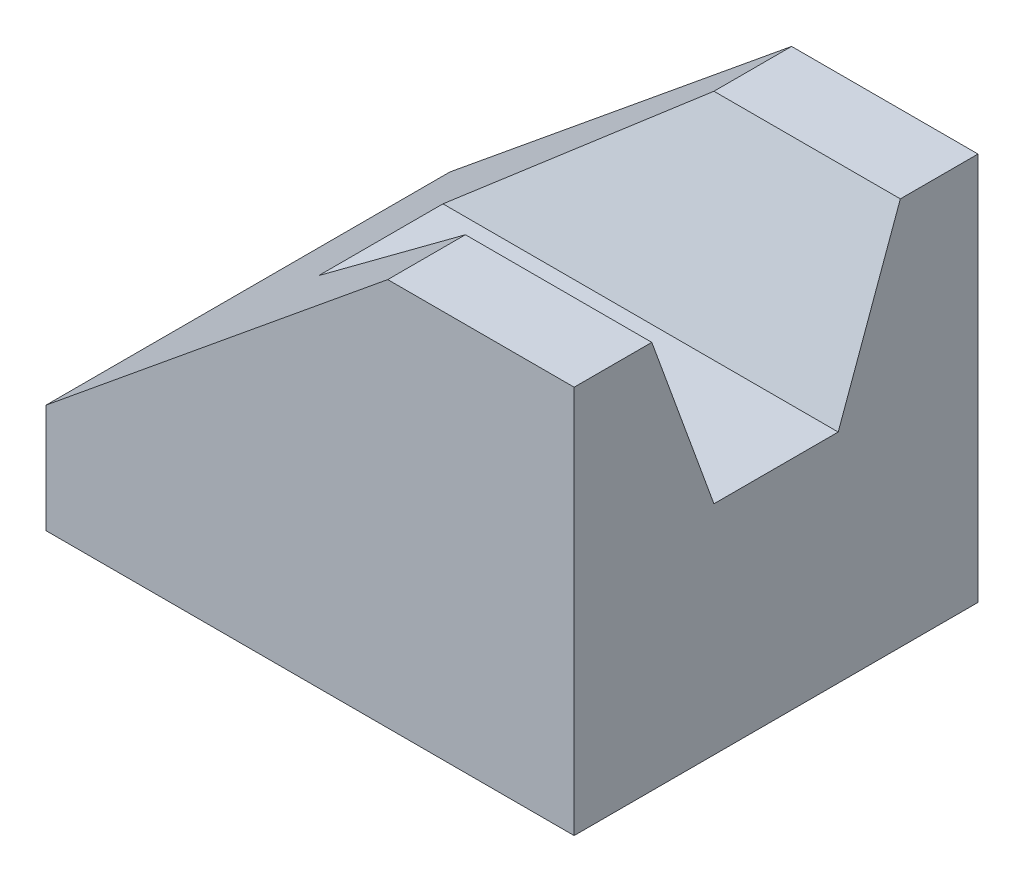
from build123d import *

# Parameters (mm, degrees)
SKETCH_1_W          = 68
SKETCH_1_H          = 52
EXTRUDE_1_DEPTH     = 50
CUT_EXTRUDE_1_DEPTH = 100.136269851
CUT_EXTRUDE_2_DEPTH = 100.136269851


with BuildPart() as part:
    # Sketch 1 → Extrude 1 (new body)
    with BuildSketch(Plane(origin=(0, 0, 0), x_dir=(1, 0, 0), z_dir=(0, 1, 0))):
        with Locations((-34, -26)):
            Rectangle(SKETCH_1_W, SKETCH_1_H)
    extrude(amount=EXTRUDE_1_DEPTH)

    # Sketch 2 → Cut-Extrude 1 (cut, through all)
    with BuildSketch(Plane.XY):
        Polygon((-24, 50), (-68, 14), (-68, 50), align=None)
    extrude(amount=CUT_EXTRUDE_1_DEPTH, mode=Mode.SUBTRACT)

    # Sketch 3 → Cut-Extrude 2 (cut, through all)
    with BuildSketch(Plane(origin=(0, 0, 0), x_dir=(0, 0, -1), z_dir=(1, 0, 0))):
        Polygon((-18, 28), (-34, 28), (-42, 50), (-10, 50), align=None)
    extrude(amount=-CUT_EXTRUDE_2_DEPTH, mode=Mode.SUBTRACT)


solid = part.part
